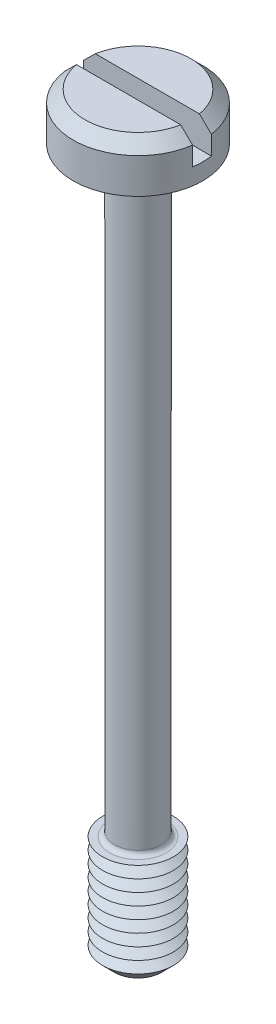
ISO-10303-21;
HEADER;
FILE_DESCRIPTION(('STEP AP214'),'2;1');
FILE_NAME('part.step','',(''),(''),'','','');
FILE_SCHEMA(('AUTOMOTIVE_DESIGN { 1 0 10303 214 1 1 1 1 }'));
ENDSEC;
DATA;
#1=APPLICATION_CONTEXT('core data for automotive mechanical design processes');
#2=APPLICATION_PROTOCOL_DEFINITION('international standard','automotive_design',2000,#1);
#3=PRODUCT_CONTEXT('',#1,'mechanical');
#4=PRODUCT('Part','Part','',(#3));
#5=PRODUCT_RELATED_PRODUCT_CATEGORY('part','',(#4));
#6=PRODUCT_DEFINITION_FORMATION('','',#4);
#7=PRODUCT_DEFINITION_CONTEXT('part definition',#1,'design');
#8=PRODUCT_DEFINITION('design','',#6,#7);
#9=PRODUCT_DEFINITION_SHAPE('','',#8);
#10=(LENGTH_UNIT() NAMED_UNIT(*) SI_UNIT(.MILLI.,.METRE.));
#11=(NAMED_UNIT(*) PLANE_ANGLE_UNIT() SI_UNIT($,.RADIAN.));
#12=(NAMED_UNIT(*) SI_UNIT($,.STERADIAN.) SOLID_ANGLE_UNIT());
#13=UNCERTAINTY_MEASURE_WITH_UNIT(LENGTH_MEASURE(1.E-05),#10,'distance_accuracy_value','');
#14=(GEOMETRIC_REPRESENTATION_CONTEXT(3) GLOBAL_UNCERTAINTY_ASSIGNED_CONTEXT((#13)) GLOBAL_UNIT_ASSIGNED_CONTEXT((#10,
#11,#12)) REPRESENTATION_CONTEXT('',''));
#15=CARTESIAN_POINT('',(0.,0.,0.));
#16=DIRECTION('',(0.,0.,1.));
#17=DIRECTION('',(1.,0.,0.));
#18=AXIS2_PLACEMENT_3D('',#15,#16,#17);
#19=CARTESIAN_POINT('',(0.,2.,0.));
#20=DIRECTION('',(0.,1.,0.));
#21=DIRECTION('',(0.,0.,1.));
#22=AXIS2_PLACEMENT_3D('',#19,#20,#21);
#23=PLANE('',#22);
#24=DIRECTION('',(-1.,0.,0.));
#25=VECTOR('',#24,1.);
#26=CARTESIAN_POINT('',(2.75,2.,-0.4));
#27=LINE('',#26,#25);
#28=CARTESIAN_POINT('',(2.21415898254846,2.,-0.4));
#29=VERTEX_POINT('',#28);
#30=CARTESIAN_POINT('',(-2.21415898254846,2.,-0.4));
#31=VERTEX_POINT('',#30);
#32=EDGE_CURVE('E110',#29,#31,#27,.T.);
#33=ORIENTED_EDGE('',*,*,#32,.F.);
#34=CARTESIAN_POINT('',(0.,2.,0.));
#35=DIRECTION('',(0.,1.,0.));
#36=DIRECTION('',(0.,0.,1.));
#37=AXIS2_PLACEMENT_3D('',#34,#35,#36);
#38=CIRCLE('',#37,2.25000000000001);
#39=EDGE_CURVE('E113',#29,#31,#38,.T.);
#40=ORIENTED_EDGE('',*,*,#39,.T.);
#41=EDGE_LOOP('',(#33,#40));
#42=FACE_BOUND('',#41,.T.);
#43=ADVANCED_FACE('F39',(#42),#23,.T.);
#44=CARTESIAN_POINT('',(0.,2.,0.));
#45=DIRECTION('',(0.,-1.,0.));
#46=DIRECTION('',(0.,0.,-1.));
#47=AXIS2_PLACEMENT_3D('',#44,#45,#46);
#48=CONICAL_SURFACE('',#47,2.25000000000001,0.785398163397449);
#49=CARTESIAN_POINT('',(6.05060089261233,-1.81380830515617,-0.4));
#50=CARTESIAN_POINT('',(5.84217393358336,-1.60583904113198,-0.4));
#51=CARTESIAN_POINT('',(5.63372707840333,-1.39788969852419,-0.4));
#52=CARTESIAN_POINT('',(5.21676338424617,-0.982052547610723,-0.4));
#53=CARTESIAN_POINT('',(5.00824654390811,-0.774164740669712,-0.4));
#54=CARTESIAN_POINT('',(4.59102343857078,-0.358383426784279,-0.4));
#55=CARTESIAN_POINT('',(4.38231713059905,-0.150489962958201,-0.4));
#56=CARTESIAN_POINT('',(3.96477014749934,0.26515359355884,-0.4));
#57=CARTESIAN_POINT('',(3.75592947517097,0.472903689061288,-0.4));
#58=CARTESIAN_POINT('',(3.33589913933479,0.890287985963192,-0.4));
#59=CARTESIAN_POINT('',(3.12470717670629,1.09991987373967,-0.4));
#60=CARTESIAN_POINT('',(2.70191340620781,1.51879562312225,-0.4));
#61=CARTESIAN_POINT('',(2.49031157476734,1.72803946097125,-0.4));
#62=CARTESIAN_POINT('',(2.17231429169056,2.04123939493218,-0.4));
#63=CARTESIAN_POINT('',(2.06623184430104,2.14551302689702,-0.4));
#64=CARTESIAN_POINT('',(1.85373145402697,2.35372301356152,-0.4));
#65=CARTESIAN_POINT('',(1.74731350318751,2.45765936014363,-0.4));
#66=CARTESIAN_POINT('',(1.53394692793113,2.6649644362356,-0.4));
#67=CARTESIAN_POINT('',(1.42699836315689,2.76833322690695,-0.4));
#68=CARTESIAN_POINT('',(1.26580938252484,2.92258234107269,-0.4));
#69=CARTESIAN_POINT('',(1.21195308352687,2.97386371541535,-0.4));
#70=CARTESIAN_POINT('',(1.10386632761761,3.07603025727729,-0.4));
#71=CARTESIAN_POINT('',(1.0496358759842,3.126915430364,-0.4));
#72=CARTESIAN_POINT('',(0.965529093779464,3.20495157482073,-0.4));
#73=CARTESIAN_POINT('',(0.935852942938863,3.23231811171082,-0.4));
#74=CARTESIAN_POINT('',(0.87628274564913,3.28681446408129,-0.4));
#75=CARTESIAN_POINT('',(0.846388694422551,3.31394427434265,-0.4));
#76=CARTESIAN_POINT('',(0.786319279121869,3.36788760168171,-0.4));
#77=CARTESIAN_POINT('',(0.756143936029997,3.39470114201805,-0.4));
#78=CARTESIAN_POINT('',(0.695411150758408,3.44788757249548,-0.4));
#79=CARTESIAN_POINT('',(0.664853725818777,3.4742604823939,-0.4));
#80=CARTESIAN_POINT('',(0.587773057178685,3.53947080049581,-0.4));
#81=CARTESIAN_POINT('',(0.540923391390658,3.57793090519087,-0.4));
#82=CARTESIAN_POINT('',(0.469108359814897,3.63368803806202,-0.4));
#83=CARTESIAN_POINT('',(0.444902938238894,3.65195872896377,-0.4));
#84=CARTESIAN_POINT('',(0.395796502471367,3.68753467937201,-0.4));
#85=CARTESIAN_POINT('',(0.370895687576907,3.70484021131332,-0.4));
#86=CARTESIAN_POINT('',(0.315135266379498,3.74129905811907,-0.4));
#87=CARTESIAN_POINT('',(0.284069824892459,3.76014262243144,-0.4));
#88=CARTESIAN_POINT('',(0.220007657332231,3.79429188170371,-0.4));
#89=CARTESIAN_POINT('',(0.187014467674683,3.80960381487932,-0.4));
#90=CARTESIAN_POINT('',(0.129469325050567,3.83013103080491,-0.4));
#91=CARTESIAN_POINT('',(0.105533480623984,3.83700748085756,-0.4));
#92=CARTESIAN_POINT('',(0.0568861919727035,3.8466714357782,-0.4));
#93=CARTESIAN_POINT('',(0.0321777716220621,3.84947323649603,-0.4));
#94=CARTESIAN_POINT('',(-0.0174556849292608,3.8503913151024,-0.4));
#95=CARTESIAN_POINT('',(-0.0423811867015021,3.84848412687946,-0.4));
#96=CARTESIAN_POINT('',(-0.0915464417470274,3.84038297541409,-0.4));
#97=CARTESIAN_POINT('',(-0.115784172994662,3.83417751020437,-0.4));
#98=CARTESIAN_POINT('',(-0.164015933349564,3.81830420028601,-0.4));
#99=CARTESIAN_POINT('',(-0.187969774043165,3.80851974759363,-0.4));
#100=CARTESIAN_POINT('',(-0.234812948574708,3.78663483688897,-0.4));
#101=CARTESIAN_POINT('',(-0.257700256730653,3.77453017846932,-0.4));
#102=CARTESIAN_POINT('',(-0.302761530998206,3.74868049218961,-0.4));
#103=CARTESIAN_POINT('',(-0.324928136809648,3.73492286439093,-0.4));
#104=CARTESIAN_POINT('',(-0.368536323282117,3.70635481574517,-0.4));
#105=CARTESIAN_POINT('',(-0.389978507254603,3.69154530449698,-0.4));
#106=CARTESIAN_POINT('',(-0.457169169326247,3.64340388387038,-0.4));
#107=CARTESIAN_POINT('',(-0.501937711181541,3.60871473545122,-0.4));
#108=CARTESIAN_POINT('',(-0.5900742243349,3.53759028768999,-0.4));
#109=CARTESIAN_POINT('',(-0.63344125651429,3.50115385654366,-0.4));
#110=CARTESIAN_POINT('',(-0.719371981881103,3.42718980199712,-0.4));
#111=CARTESIAN_POINT('',(-0.761934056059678,3.38966030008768,-0.4));
#112=CARTESIAN_POINT('',(-0.846465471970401,3.3139686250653,-0.4));
#113=CARTESIAN_POINT('',(-0.888434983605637,3.27580664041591,-0.4));
#114=CARTESIAN_POINT('',(-1.01351008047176,3.16091722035,-0.4));
#115=CARTESIAN_POINT('',(-1.0960373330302,3.08356131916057,-0.4));
#116=CARTESIAN_POINT('',(-1.26020205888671,2.9280930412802,-0.4));
#117=CARTESIAN_POINT('',(-1.34184039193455,2.84998156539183,-0.4));
#118=CARTESIAN_POINT('',(-1.50425180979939,2.69362860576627,-0.4));
#119=CARTESIAN_POINT('',(-1.58502715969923,2.61538947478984,-0.4));
#120=CARTESIAN_POINT('',(-1.74627332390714,2.45859784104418,-0.4));
#121=CARTESIAN_POINT('',(-1.82674413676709,2.38004533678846,-0.4));
#122=CARTESIAN_POINT('',(-2.06785619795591,2.14407469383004,-0.4));
#123=CARTESIAN_POINT('',(-2.22819388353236,1.98634651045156,-0.4));
#124=CARTESIAN_POINT('',(-2.54852691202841,1.670404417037,-0.4));
#125=CARTESIAN_POINT('',(-2.70852207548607,1.51219032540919,-0.4));
#126=CARTESIAN_POINT('',(-3.02826273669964,1.19551306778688,-0.4));
#127=CARTESIAN_POINT('',(-3.18800823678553,1.03704990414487,-0.4));
#128=CARTESIAN_POINT('',(-3.66699080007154,0.561455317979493,-0.4));
#129=CARTESIAN_POINT('',(-3.98599924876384,0.244093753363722,-0.4));
#130=CARTESIAN_POINT('',(-4.62369880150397,-0.390879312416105,-0.4));
#131=CARTESIAN_POINT('',(-4.9423899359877,-0.708490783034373,-0.4));
#132=CARTESIAN_POINT('',(-5.39262624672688,-1.15743192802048,-0.4));
#133=CARTESIAN_POINT('',(-5.52423897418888,-1.2886938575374,-0.4));
#134=CARTESIAN_POINT('',(-5.78743776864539,-1.55123695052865,-0.4));
#135=CARTESIAN_POINT('',(-5.91902383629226,-1.68251811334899,-0.4));
#136=CARTESIAN_POINT('',(-6.05060089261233,-1.81380830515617,-0.4));
#137=B_SPLINE_CURVE_WITH_KNOTS('',3,(#49,#50,#51,#52,#53,#54,#55,#56,#57,#58,#59,#60,#61,#62,
#63,#64,#65,#66,#67,#68,#69,#70,#71,#72,#73,#74,#75,#76,#77,#78,#79,#80,#81,#82,#83,#84,#85,#86,
#87,#88,#89,#90,#91,#92,#93,#94,#95,#96,#97,#98,#99,#100,#101,#102,#103,#104,#105,#106,#107,
#108,#109,#110,#111,#112,#113,#114,#115,#116,#117,#118,#119,#120,#121,#122,#123,#124,#125,#126,
#127,#128,#129,#130,#131,#132,#133,#134,#135,#136),.UNSPECIFIED.,.F.,.F.,(4,2,2,2,2,2,2,2,2,2,2,
2,2,2,2,2,2,2,2,2,2,2,2,2,2,2,2,2,2,2,2,2,2,2,2,2,2,2,2,2,2,2,2,4),(0.,0.883310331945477,
1.76663897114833,2.65038219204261,3.53410755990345,4.42681573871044,5.31957687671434,
5.76582544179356,6.21208466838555,6.65829482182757,6.88139126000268,7.10448455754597,
7.22558850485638,7.34669511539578,7.46779276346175,7.58888496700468,7.77066509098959,
7.86163037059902,7.95256984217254,8.06146372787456,8.17016376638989,8.24461141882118,
8.3187972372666,8.39335348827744,8.46811002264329,8.54555790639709,8.62314734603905,
8.70137101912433,8.77952785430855,8.949327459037,9.11923857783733,9.28946128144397,
9.45963414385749,9.79895964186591,10.1379210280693,10.475282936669,10.8126464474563,
11.4873867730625,12.1624208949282,12.8374486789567,14.1873973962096,15.5372009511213,
16.0948428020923,16.6524687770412),.UNSPECIFIED.);
#138=CARTESIAN_POINT('',(2.72075357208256,1.50000000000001,-0.4));
#139=VERTEX_POINT('',#138);
#140=EDGE_CURVE('E259',#139,#29,#137,.T.);
#141=ORIENTED_EDGE('',*,*,#140,.F.);
#142=CARTESIAN_POINT('',(0.,1.50000000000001,0.));
#143=DIRECTION('',(0.,1.,0.));
#144=DIRECTION('',(0.,0.,1.));
#145=AXIS2_PLACEMENT_3D('',#142,#143,#144);
#146=CIRCLE('',#145,2.75);
#147=CARTESIAN_POINT('',(-2.72075357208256,1.50000000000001,-0.4));
#148=VERTEX_POINT('',#147);
#149=EDGE_CURVE('E127',#148,#139,#146,.F.);
#150=ORIENTED_EDGE('',*,*,#149,.F.);
#151=EDGE_CURVE('E102',#31,#148,#137,.T.);
#152=ORIENTED_EDGE('',*,*,#151,.F.);
#153=ORIENTED_EDGE('',*,*,#39,.F.);
#154=EDGE_LOOP('',(#141,#150,#152,#153));
#155=FACE_BOUND('',#154,.T.);
#156=ADVANCED_FACE('F221',(#155),#48,.T.);
#157=CARTESIAN_POINT('',(0.,-30.,0.));
#158=DIRECTION('',(0.,1.,0.));
#159=DIRECTION('',(0.,0.,1.));
#160=AXIS2_PLACEMENT_3D('',#157,#158,#159);
#161=CYLINDRICAL_SURFACE('',#160,1.);
#162=CARTESIAN_POINT('',(0.,-25.3,0.));
#163=DIRECTION('',(0.,-1.,0.));
#164=DIRECTION('',(0.,0.,-1.));
#165=AXIS2_PLACEMENT_3D('',#162,#163,#164);
#166=CIRCLE('',#165,1.);
#167=CARTESIAN_POINT('',(0.,-25.3,-1.));
#168=VERTEX_POINT('',#167);
#169=EDGE_CURVE('E122',#168,#168,#166,.F.);
#170=ORIENTED_EDGE('',*,*,#169,.T.);
#171=EDGE_LOOP('',(#170));
#172=FACE_BOUND('',#171,.T.);
#173=CARTESIAN_POINT('',(0.,-0.199999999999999,0.));
#174=DIRECTION('',(0.,1.,0.));
#175=DIRECTION('',(0.,0.,1.));
#176=AXIS2_PLACEMENT_3D('',#173,#174,#175);
#177=CIRCLE('',#176,1.);
#178=CARTESIAN_POINT('',(0.,-0.199999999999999,1.));
#179=VERTEX_POINT('',#178);
#180=EDGE_CURVE('E365',#179,#179,#177,.F.);
#181=ORIENTED_EDGE('',*,*,#180,.T.);
#182=EDGE_LOOP('',(#181));
#183=FACE_BOUND('',#182,.T.);
#184=ADVANCED_FACE('F217',(#172,#183),#161,.T.);
#185=CARTESIAN_POINT('',(0.,2.,0.));
#186=DIRECTION('',(0.,-1.,0.));
#187=DIRECTION('',(0.,0.,-1.));
#188=AXIS2_PLACEMENT_3D('',#185,#186,#187);
#189=CYLINDRICAL_SURFACE('',#188,2.75);
#190=ORIENTED_EDGE('',*,*,#149,.T.);
#191=DIRECTION('',(0.,-1.,0.));
#192=VECTOR('',#191,1.);
#193=CARTESIAN_POINT('',(2.72075357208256,2.,-0.4));
#194=LINE('',#193,#192);
#195=CARTESIAN_POINT('',(2.72075357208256,0.7,-0.4));
#196=VERTEX_POINT('',#195);
#197=EDGE_CURVE('E64',#139,#196,#194,.T.);
#198=ORIENTED_EDGE('',*,*,#197,.T.);
#199=CARTESIAN_POINT('',(0.,0.7,0.));
#200=DIRECTION('',(0.,1.,0.));
#201=DIRECTION('',(0.,0.,1.));
#202=AXIS2_PLACEMENT_3D('',#199,#200,#201);
#203=CIRCLE('',#202,2.75);
#204=CARTESIAN_POINT('',(2.72075357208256,0.7,0.4));
#205=VERTEX_POINT('',#204);
#206=EDGE_CURVE('E11',#205,#196,#203,.T.);
#207=ORIENTED_EDGE('',*,*,#206,.F.);
#208=DIRECTION('',(0.,-1.,0.));
#209=VECTOR('',#208,1.);
#210=CARTESIAN_POINT('',(2.72075357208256,2.,0.4));
#211=LINE('',#210,#209);
#212=CARTESIAN_POINT('',(2.72075357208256,1.50000000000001,0.4));
#213=VERTEX_POINT('',#212);
#214=EDGE_CURVE('E276',#205,#213,#211,.F.);
#215=ORIENTED_EDGE('',*,*,#214,.T.);
#216=CARTESIAN_POINT('',(-2.72075357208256,1.50000000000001,0.4));
#217=VERTEX_POINT('',#216);
#218=EDGE_CURVE('E119',#213,#217,#146,.F.);
#219=ORIENTED_EDGE('',*,*,#218,.T.);
#220=DIRECTION('',(0.,-1.,0.));
#221=VECTOR('',#220,1.);
#222=CARTESIAN_POINT('',(-2.72075357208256,2.,0.4));
#223=LINE('',#222,#221);
#224=CARTESIAN_POINT('',(-2.72075357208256,0.7,0.4));
#225=VERTEX_POINT('',#224);
#226=EDGE_CURVE('E96',#217,#225,#223,.T.);
#227=ORIENTED_EDGE('',*,*,#226,.T.);
#228=CARTESIAN_POINT('',(-2.72075357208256,0.7,-0.4));
#229=VERTEX_POINT('',#228);
#230=EDGE_CURVE('E44',#229,#225,#203,.T.);
#231=ORIENTED_EDGE('',*,*,#230,.F.);
#232=DIRECTION('',(0.,-1.,0.));
#233=VECTOR('',#232,1.);
#234=CARTESIAN_POINT('',(-2.72075357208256,2.,-0.4));
#235=LINE('',#234,#233);
#236=EDGE_CURVE('E281',#229,#148,#235,.F.);
#237=ORIENTED_EDGE('',*,*,#236,.T.);
#238=EDGE_LOOP('',(#190,#198,#207,#215,#219,#227,#231,#237));
#239=FACE_BOUND('',#238,.T.);
#240=CARTESIAN_POINT('',(0.,0.,0.));
#241=DIRECTION('',(0.,1.,0.));
#242=DIRECTION('',(0.,0.,1.));
#243=AXIS2_PLACEMENT_3D('',#240,#241,#242);
#244=CIRCLE('',#243,2.75);
#245=CARTESIAN_POINT('',(0.,0.,2.75));
#246=VERTEX_POINT('',#245);
#247=EDGE_CURVE('E354',#246,#246,#244,.T.);
#248=ORIENTED_EDGE('',*,*,#247,.T.);
#249=EDGE_LOOP('',(#248));
#250=FACE_BOUND('',#249,.T.);
#251=ADVANCED_FACE('F220',(#239,#250),#189,.T.);
#252=DIRECTION('',(1.,0.,0.));
#253=VECTOR('',#252,1.);
#254=CARTESIAN_POINT('',(2.75,2.,0.4));
#255=LINE('',#254,#253);
#256=CARTESIAN_POINT('',(-2.21415898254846,2.,0.4));
#257=VERTEX_POINT('',#256);
#258=CARTESIAN_POINT('',(2.21415898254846,2.,0.4));
#259=VERTEX_POINT('',#258);
#260=EDGE_CURVE('E56',#257,#259,#255,.T.);
#261=ORIENTED_EDGE('',*,*,#260,.F.);
#262=EDGE_CURVE('E108',#257,#259,#38,.T.);
#263=ORIENTED_EDGE('',*,*,#262,.T.);
#264=EDGE_LOOP('',(#261,#263));
#265=FACE_BOUND('',#264,.T.);
#266=ADVANCED_FACE('F107',(#265),#23,.T.);
#267=CARTESIAN_POINT('',(0.,0.,0.));
#268=DIRECTION('',(0.,1.,0.));
#269=DIRECTION('',(0.,0.,1.));
#270=AXIS2_PLACEMENT_3D('',#267,#268,#269);
#271=PLANE('',#270);
#272=CARTESIAN_POINT('',(0.,0.,0.));
#273=DIRECTION('',(0.,1.,0.));
#274=DIRECTION('',(0.,0.,1.));
#275=AXIS2_PLACEMENT_3D('',#272,#273,#274);
#276=CIRCLE('',#275,1.2);
#277=CARTESIAN_POINT('',(0.,0.,1.2));
#278=VERTEX_POINT('',#277);
#279=EDGE_CURVE('E114',#278,#278,#276,.T.);
#280=ORIENTED_EDGE('',*,*,#279,.T.);
#281=EDGE_LOOP('',(#280));
#282=FACE_BOUND('',#281,.T.);
#283=ORIENTED_EDGE('',*,*,#247,.F.);
#284=EDGE_LOOP('',(#283));
#285=FACE_BOUND('',#284,.T.);
#286=ADVANCED_FACE('F211',(#282,#285),#271,.F.);
#287=CARTESIAN_POINT('',(0.,-25.5,0.));
#288=DIRECTION('',(0.,-1.,0.));
#289=DIRECTION('',(0.,0.,-1.));
#290=AXIS2_PLACEMENT_3D('',#287,#288,#289);
#291=PLANE('',#290);
#292=CARTESIAN_POINT('',(0.,-25.5,0.));
#293=DIRECTION('',(0.,-1.,0.));
#294=DIRECTION('',(0.,0.,-1.));
#295=AXIS2_PLACEMENT_3D('',#292,#293,#294);
#296=CIRCLE('',#295,1.2);
#297=CARTESIAN_POINT('',(0.,-25.5,-1.2));
#298=VERTEX_POINT('',#297);
#299=EDGE_CURVE('E362',#298,#298,#296,.T.);
#300=ORIENTED_EDGE('',*,*,#299,.T.);
#301=EDGE_LOOP('',(#300));
#302=FACE_BOUND('',#301,.T.);
#303=CARTESIAN_POINT('',(0.,-25.5,0.));
#304=DIRECTION('',(0.,1.,0.));
#305=DIRECTION('',(0.,0.,1.));
#306=AXIS2_PLACEMENT_3D('',#303,#304,#305);
#307=CIRCLE('',#306,1.5);
#308=CARTESIAN_POINT('',(0.,-25.5,1.5));
#309=VERTEX_POINT('',#308);
#310=EDGE_CURVE('E350',#309,#309,#307,.T.);
#311=ORIENTED_EDGE('',*,*,#310,.T.);
#312=EDGE_LOOP('',(#311));
#313=FACE_BOUND('',#312,.T.);
#314=ADVANCED_FACE('F207',(#302,#313),#291,.F.);
#315=CARTESIAN_POINT('',(0.,-25.75,0.));
#316=DIRECTION('',(0.,1.,0.));
#317=DIRECTION('',(0.,0.,1.));
#318=AXIS2_PLACEMENT_3D('',#315,#316,#317);
#319=CONICAL_SURFACE('',#318,1.06698729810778,1.0471975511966);
#320=ORIENTED_EDGE('',*,*,#310,.F.);
#321=EDGE_LOOP('',(#320));
#322=FACE_BOUND('',#321,.T.);
#323=CARTESIAN_POINT('',(0.,-25.75,0.));
#324=DIRECTION('',(0.,1.,0.));
#325=DIRECTION('',(0.,0.,1.));
#326=AXIS2_PLACEMENT_3D('',#323,#324,#325);
#327=CIRCLE('',#326,1.06698729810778);
#328=CARTESIAN_POINT('',(0.,-25.75,1.06698729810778));
#329=VERTEX_POINT('',#328);
#330=EDGE_CURVE('E346',#329,#329,#327,.T.);
#331=ORIENTED_EDGE('',*,*,#330,.T.);
#332=EDGE_LOOP('',(#331));
#333=FACE_BOUND('',#332,.T.);
#334=ADVANCED_FACE('F203',(#322,#333),#319,.T.);
#335=CARTESIAN_POINT('',(0.,-26.,0.));
#336=DIRECTION('',(0.,-1.,0.));
#337=DIRECTION('',(0.,0.,-1.));
#338=AXIS2_PLACEMENT_3D('',#335,#336,#337);
#339=CONICAL_SURFACE('',#338,1.5,1.0471975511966);
#340=ORIENTED_EDGE('',*,*,#330,.F.);
#341=EDGE_LOOP('',(#340));
#342=FACE_BOUND('',#341,.T.);
#343=CARTESIAN_POINT('',(0.,-26.,0.));
#344=DIRECTION('',(0.,1.,0.));
#345=DIRECTION('',(0.,0.,1.));
#346=AXIS2_PLACEMENT_3D('',#343,#344,#345);
#347=CIRCLE('',#346,1.5);
#348=CARTESIAN_POINT('',(0.,-26.,1.5));
#349=VERTEX_POINT('',#348);
#350=EDGE_CURVE('E342',#349,#349,#347,.T.);
#351=ORIENTED_EDGE('',*,*,#350,.T.);
#352=EDGE_LOOP('',(#351));
#353=FACE_BOUND('',#352,.T.);
#354=ADVANCED_FACE('F199',(#342,#353),#339,.T.);
#355=CARTESIAN_POINT('',(0.,-26.25,0.));
#356=DIRECTION('',(0.,1.,0.));
#357=DIRECTION('',(0.,0.,1.));
#358=AXIS2_PLACEMENT_3D('',#355,#356,#357);
#359=CONICAL_SURFACE('',#358,1.06698729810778,1.0471975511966);
#360=ORIENTED_EDGE('',*,*,#350,.F.);
#361=EDGE_LOOP('',(#360));
#362=FACE_BOUND('',#361,.T.);
#363=CARTESIAN_POINT('',(0.,-26.25,0.));
#364=DIRECTION('',(0.,1.,0.));
#365=DIRECTION('',(0.,0.,1.));
#366=AXIS2_PLACEMENT_3D('',#363,#364,#365);
#367=CIRCLE('',#366,1.06698729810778);
#368=CARTESIAN_POINT('',(0.,-26.25,1.06698729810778));
#369=VERTEX_POINT('',#368);
#370=EDGE_CURVE('E338',#369,#369,#367,.T.);
#371=ORIENTED_EDGE('',*,*,#370,.T.);
#372=EDGE_LOOP('',(#371));
#373=FACE_BOUND('',#372,.T.);
#374=ADVANCED_FACE('F195',(#362,#373),#359,.T.);
#375=CARTESIAN_POINT('',(0.,-26.5,0.));
#376=DIRECTION('',(0.,-1.,0.));
#377=DIRECTION('',(0.,0.,-1.));
#378=AXIS2_PLACEMENT_3D('',#375,#376,#377);
#379=CONICAL_SURFACE('',#378,1.5,1.0471975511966);
#380=ORIENTED_EDGE('',*,*,#370,.F.);
#381=EDGE_LOOP('',(#380));
#382=FACE_BOUND('',#381,.T.);
#383=CARTESIAN_POINT('',(0.,-26.5,0.));
#384=DIRECTION('',(0.,1.,0.));
#385=DIRECTION('',(0.,0.,1.));
#386=AXIS2_PLACEMENT_3D('',#383,#384,#385);
#387=CIRCLE('',#386,1.5);
#388=CARTESIAN_POINT('',(0.,-26.5,1.5));
#389=VERTEX_POINT('',#388);
#390=EDGE_CURVE('E335',#389,#389,#387,.T.);
#391=ORIENTED_EDGE('',*,*,#390,.T.);
#392=EDGE_LOOP('',(#391));
#393=FACE_BOUND('',#392,.T.);
#394=ADVANCED_FACE('F191',(#382,#393),#379,.T.);
#395=CARTESIAN_POINT('',(0.,-26.75,0.));
#396=DIRECTION('',(0.,1.,0.));
#397=DIRECTION('',(0.,0.,1.));
#398=AXIS2_PLACEMENT_3D('',#395,#396,#397);
#399=CONICAL_SURFACE('',#398,1.06698729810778,1.0471975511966);
#400=ORIENTED_EDGE('',*,*,#390,.F.);
#401=EDGE_LOOP('',(#400));
#402=FACE_BOUND('',#401,.T.);
#403=CARTESIAN_POINT('',(0.,-26.75,0.));
#404=DIRECTION('',(0.,1.,0.));
#405=DIRECTION('',(0.,0.,1.));
#406=AXIS2_PLACEMENT_3D('',#403,#404,#405);
#407=CIRCLE('',#406,1.06698729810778);
#408=CARTESIAN_POINT('',(0.,-26.75,1.06698729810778));
#409=VERTEX_POINT('',#408);
#410=EDGE_CURVE('E332',#409,#409,#407,.T.);
#411=ORIENTED_EDGE('',*,*,#410,.T.);
#412=EDGE_LOOP('',(#411));
#413=FACE_BOUND('',#412,.T.);
#414=ADVANCED_FACE('F187',(#402,#413),#399,.T.);
#415=CARTESIAN_POINT('',(0.,-27.,0.));
#416=DIRECTION('',(0.,-1.,0.));
#417=DIRECTION('',(0.,0.,-1.));
#418=AXIS2_PLACEMENT_3D('',#415,#416,#417);
#419=CONICAL_SURFACE('',#418,1.5,1.0471975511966);
#420=ORIENTED_EDGE('',*,*,#410,.F.);
#421=EDGE_LOOP('',(#420));
#422=FACE_BOUND('',#421,.T.);
#423=CARTESIAN_POINT('',(0.,-27.,0.));
#424=DIRECTION('',(0.,1.,0.));
#425=DIRECTION('',(0.,0.,1.));
#426=AXIS2_PLACEMENT_3D('',#423,#424,#425);
#427=CIRCLE('',#426,1.5);
#428=CARTESIAN_POINT('',(0.,-27.,1.5));
#429=VERTEX_POINT('',#428);
#430=EDGE_CURVE('E328',#429,#429,#427,.T.);
#431=ORIENTED_EDGE('',*,*,#430,.T.);
#432=EDGE_LOOP('',(#431));
#433=FACE_BOUND('',#432,.T.);
#434=ADVANCED_FACE('F183',(#422,#433),#419,.T.);
#435=CARTESIAN_POINT('',(0.,-27.25,0.));
#436=DIRECTION('',(0.,1.,0.));
#437=DIRECTION('',(0.,0.,1.));
#438=AXIS2_PLACEMENT_3D('',#435,#436,#437);
#439=CONICAL_SURFACE('',#438,1.06698729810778,1.0471975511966);
#440=ORIENTED_EDGE('',*,*,#430,.F.);
#441=EDGE_LOOP('',(#440));
#442=FACE_BOUND('',#441,.T.);
#443=CARTESIAN_POINT('',(0.,-27.25,0.));
#444=DIRECTION('',(0.,1.,0.));
#445=DIRECTION('',(0.,0.,1.));
#446=AXIS2_PLACEMENT_3D('',#443,#444,#445);
#447=CIRCLE('',#446,1.06698729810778);
#448=CARTESIAN_POINT('',(0.,-27.25,1.06698729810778));
#449=VERTEX_POINT('',#448);
#450=EDGE_CURVE('E324',#449,#449,#447,.T.);
#451=ORIENTED_EDGE('',*,*,#450,.T.);
#452=EDGE_LOOP('',(#451));
#453=FACE_BOUND('',#452,.T.);
#454=ADVANCED_FACE('F179',(#442,#453),#439,.T.);
#455=CARTESIAN_POINT('',(0.,-27.5,0.));
#456=DIRECTION('',(0.,-1.,0.));
#457=DIRECTION('',(0.,0.,-1.));
#458=AXIS2_PLACEMENT_3D('',#455,#456,#457);
#459=CONICAL_SURFACE('',#458,1.5,1.0471975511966);
#460=ORIENTED_EDGE('',*,*,#450,.F.);
#461=EDGE_LOOP('',(#460));
#462=FACE_BOUND('',#461,.T.);
#463=CARTESIAN_POINT('',(0.,-27.5,0.));
#464=DIRECTION('',(0.,1.,0.));
#465=DIRECTION('',(0.,0.,1.));
#466=AXIS2_PLACEMENT_3D('',#463,#464,#465);
#467=CIRCLE('',#466,1.5);
#468=CARTESIAN_POINT('',(0.,-27.5,1.5));
#469=VERTEX_POINT('',#468);
#470=EDGE_CURVE('E320',#469,#469,#467,.T.);
#471=ORIENTED_EDGE('',*,*,#470,.T.);
#472=EDGE_LOOP('',(#471));
#473=FACE_BOUND('',#472,.T.);
#474=ADVANCED_FACE('F175',(#462,#473),#459,.T.);
#475=CARTESIAN_POINT('',(0.,-27.75,0.));
#476=DIRECTION('',(0.,1.,0.));
#477=DIRECTION('',(0.,0.,1.));
#478=AXIS2_PLACEMENT_3D('',#475,#476,#477);
#479=CONICAL_SURFACE('',#478,1.06698729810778,1.0471975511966);
#480=ORIENTED_EDGE('',*,*,#470,.F.);
#481=EDGE_LOOP('',(#480));
#482=FACE_BOUND('',#481,.T.);
#483=CARTESIAN_POINT('',(0.,-27.75,0.));
#484=DIRECTION('',(0.,1.,0.));
#485=DIRECTION('',(0.,0.,1.));
#486=AXIS2_PLACEMENT_3D('',#483,#484,#485);
#487=CIRCLE('',#486,1.06698729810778);
#488=CARTESIAN_POINT('',(0.,-27.75,1.06698729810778));
#489=VERTEX_POINT('',#488);
#490=EDGE_CURVE('E317',#489,#489,#487,.T.);
#491=ORIENTED_EDGE('',*,*,#490,.T.);
#492=EDGE_LOOP('',(#491));
#493=FACE_BOUND('',#492,.T.);
#494=ADVANCED_FACE('F171',(#482,#493),#479,.T.);
#495=CARTESIAN_POINT('',(0.,-28.,0.));
#496=DIRECTION('',(0.,-1.,0.));
#497=DIRECTION('',(0.,0.,-1.));
#498=AXIS2_PLACEMENT_3D('',#495,#496,#497);
#499=CONICAL_SURFACE('',#498,1.5,1.0471975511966);
#500=ORIENTED_EDGE('',*,*,#490,.F.);
#501=EDGE_LOOP('',(#500));
#502=FACE_BOUND('',#501,.T.);
#503=CARTESIAN_POINT('',(0.,-28.,0.));
#504=DIRECTION('',(0.,1.,0.));
#505=DIRECTION('',(0.,0.,1.));
#506=AXIS2_PLACEMENT_3D('',#503,#504,#505);
#507=CIRCLE('',#506,1.5);
#508=CARTESIAN_POINT('',(0.,-28.,1.5));
#509=VERTEX_POINT('',#508);
#510=EDGE_CURVE('E313',#509,#509,#507,.T.);
#511=ORIENTED_EDGE('',*,*,#510,.T.);
#512=EDGE_LOOP('',(#511));
#513=FACE_BOUND('',#512,.T.);
#514=ADVANCED_FACE('F167',(#502,#513),#499,.T.);
#515=CARTESIAN_POINT('',(0.,-28.25,0.));
#516=DIRECTION('',(0.,1.,0.));
#517=DIRECTION('',(0.,0.,1.));
#518=AXIS2_PLACEMENT_3D('',#515,#516,#517);
#519=CONICAL_SURFACE('',#518,1.06698729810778,1.0471975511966);
#520=ORIENTED_EDGE('',*,*,#510,.F.);
#521=EDGE_LOOP('',(#520));
#522=FACE_BOUND('',#521,.T.);
#523=CARTESIAN_POINT('',(0.,-28.25,0.));
#524=DIRECTION('',(0.,1.,0.));
#525=DIRECTION('',(0.,0.,1.));
#526=AXIS2_PLACEMENT_3D('',#523,#524,#525);
#527=CIRCLE('',#526,1.06698729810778);
#528=CARTESIAN_POINT('',(0.,-28.25,1.06698729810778));
#529=VERTEX_POINT('',#528);
#530=EDGE_CURVE('E310',#529,#529,#527,.T.);
#531=ORIENTED_EDGE('',*,*,#530,.T.);
#532=EDGE_LOOP('',(#531));
#533=FACE_BOUND('',#532,.T.);
#534=ADVANCED_FACE('F163',(#522,#533),#519,.T.);
#535=CARTESIAN_POINT('',(0.,-28.5,0.));
#536=DIRECTION('',(0.,-1.,0.));
#537=DIRECTION('',(0.,0.,-1.));
#538=AXIS2_PLACEMENT_3D('',#535,#536,#537);
#539=CONICAL_SURFACE('',#538,1.5,1.0471975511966);
#540=ORIENTED_EDGE('',*,*,#530,.F.);
#541=EDGE_LOOP('',(#540));
#542=FACE_BOUND('',#541,.T.);
#543=CARTESIAN_POINT('',(0.,-28.5,0.));
#544=DIRECTION('',(0.,1.,0.));
#545=DIRECTION('',(0.,0.,1.));
#546=AXIS2_PLACEMENT_3D('',#543,#544,#545);
#547=CIRCLE('',#546,1.5);
#548=CARTESIAN_POINT('',(0.,-28.5,1.5));
#549=VERTEX_POINT('',#548);
#550=EDGE_CURVE('E306',#549,#549,#547,.T.);
#551=ORIENTED_EDGE('',*,*,#550,.T.);
#552=EDGE_LOOP('',(#551));
#553=FACE_BOUND('',#552,.T.);
#554=ADVANCED_FACE('F159',(#542,#553),#539,.T.);
#555=CARTESIAN_POINT('',(0.,-28.75,0.));
#556=DIRECTION('',(0.,1.,0.));
#557=DIRECTION('',(0.,0.,1.));
#558=AXIS2_PLACEMENT_3D('',#555,#556,#557);
#559=CONICAL_SURFACE('',#558,1.06698729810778,1.0471975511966);
#560=ORIENTED_EDGE('',*,*,#550,.F.);
#561=EDGE_LOOP('',(#560));
#562=FACE_BOUND('',#561,.T.);
#563=CARTESIAN_POINT('',(0.,-28.75,0.));
#564=DIRECTION('',(0.,1.,0.));
#565=DIRECTION('',(0.,0.,1.));
#566=AXIS2_PLACEMENT_3D('',#563,#564,#565);
#567=CIRCLE('',#566,1.06698729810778);
#568=CARTESIAN_POINT('',(0.,-28.75,1.06698729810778));
#569=VERTEX_POINT('',#568);
#570=EDGE_CURVE('E302',#569,#569,#567,.T.);
#571=ORIENTED_EDGE('',*,*,#570,.T.);
#572=EDGE_LOOP('',(#571));
#573=FACE_BOUND('',#572,.T.);
#574=ADVANCED_FACE('F155',(#562,#573),#559,.T.);
#575=CARTESIAN_POINT('',(0.,-29.,0.));
#576=DIRECTION('',(0.,-1.,0.));
#577=DIRECTION('',(0.,0.,-1.));
#578=AXIS2_PLACEMENT_3D('',#575,#576,#577);
#579=CONICAL_SURFACE('',#578,1.5,1.0471975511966);
#580=ORIENTED_EDGE('',*,*,#570,.F.);
#581=EDGE_LOOP('',(#580));
#582=FACE_BOUND('',#581,.T.);
#583=CARTESIAN_POINT('',(0.,-29.,0.));
#584=DIRECTION('',(0.,1.,0.));
#585=DIRECTION('',(0.,0.,1.));
#586=AXIS2_PLACEMENT_3D('',#583,#584,#585);
#587=CIRCLE('',#586,1.5);
#588=CARTESIAN_POINT('',(0.,-29.,1.5));
#589=VERTEX_POINT('',#588);
#590=EDGE_CURVE('E298',#589,#589,#587,.T.);
#591=ORIENTED_EDGE('',*,*,#590,.T.);
#592=EDGE_LOOP('',(#591));
#593=FACE_BOUND('',#592,.T.);
#594=ADVANCED_FACE('F151',(#582,#593),#579,.T.);
#595=CARTESIAN_POINT('',(0.,-29.25,0.));
#596=DIRECTION('',(0.,1.,0.));
#597=DIRECTION('',(0.,0.,1.));
#598=AXIS2_PLACEMENT_3D('',#595,#596,#597);
#599=CONICAL_SURFACE('',#598,1.06698729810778,1.0471975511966);
#600=ORIENTED_EDGE('',*,*,#590,.F.);
#601=EDGE_LOOP('',(#600));
#602=FACE_BOUND('',#601,.T.);
#603=CARTESIAN_POINT('',(0.,-29.25,0.));
#604=DIRECTION('',(0.,1.,0.));
#605=DIRECTION('',(0.,0.,1.));
#606=AXIS2_PLACEMENT_3D('',#603,#604,#605);
#607=CIRCLE('',#606,1.06698729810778);
#608=CARTESIAN_POINT('',(0.,-29.25,1.06698729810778));
#609=VERTEX_POINT('',#608);
#610=EDGE_CURVE('E295',#609,#609,#607,.T.);
#611=ORIENTED_EDGE('',*,*,#610,.T.);
#612=EDGE_LOOP('',(#611));
#613=FACE_BOUND('',#612,.T.);
#614=ADVANCED_FACE('F147',(#602,#613),#599,.T.);
#615=CARTESIAN_POINT('',(0.,-29.5,0.));
#616=DIRECTION('',(0.,-1.,0.));
#617=DIRECTION('',(0.,0.,-1.));
#618=AXIS2_PLACEMENT_3D('',#615,#616,#617);
#619=CONICAL_SURFACE('',#618,1.5,1.0471975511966);
#620=ORIENTED_EDGE('',*,*,#610,.F.);
#621=EDGE_LOOP('',(#620));
#622=FACE_BOUND('',#621,.T.);
#623=CARTESIAN_POINT('',(0.,-29.5,0.));
#624=DIRECTION('',(0.,1.,0.));
#625=DIRECTION('',(0.,0.,1.));
#626=AXIS2_PLACEMENT_3D('',#623,#624,#625);
#627=CIRCLE('',#626,1.5);
#628=CARTESIAN_POINT('',(0.,-29.5,1.5));
#629=VERTEX_POINT('',#628);
#630=EDGE_CURVE('E291',#629,#629,#627,.T.);
#631=ORIENTED_EDGE('',*,*,#630,.T.);
#632=EDGE_LOOP('',(#631));
#633=FACE_BOUND('',#632,.T.);
#634=ADVANCED_FACE('F143',(#622,#633),#619,.T.);
#635=CARTESIAN_POINT('',(0.,-30.,0.));
#636=DIRECTION('',(0.,-1.,0.));
#637=DIRECTION('',(0.,0.,-1.));
#638=AXIS2_PLACEMENT_3D('',#635,#636,#637);
#639=PLANE('',#638);
#640=CARTESIAN_POINT('',(0.,-30.,0.));
#641=DIRECTION('',(0.,-1.,0.));
#642=DIRECTION('',(0.,0.,-1.));
#643=AXIS2_PLACEMENT_3D('',#640,#641,#642);
#644=CIRCLE('',#643,1.00000000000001);
#645=CARTESIAN_POINT('',(0.,-30.,-1.00000000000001));
#646=VERTEX_POINT('',#645);
#647=EDGE_CURVE('E358',#646,#646,#644,.T.);
#648=ORIENTED_EDGE('',*,*,#647,.T.);
#649=EDGE_LOOP('',(#648));
#650=FACE_BOUND('',#649,.T.);
#651=ADVANCED_FACE('F146',(#650),#639,.T.);
#652=CARTESIAN_POINT('',(0.,-30.,0.));
#653=DIRECTION('',(0.,1.,0.));
#654=DIRECTION('',(0.,0.,1.));
#655=AXIS2_PLACEMENT_3D('',#652,#653,#654);
#656=CONICAL_SURFACE('',#655,1.00000000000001,0.785398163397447);
#657=ORIENTED_EDGE('',*,*,#630,.F.);
#658=EDGE_LOOP('',(#657));
#659=FACE_BOUND('',#658,.T.);
#660=ORIENTED_EDGE('',*,*,#647,.F.);
#661=EDGE_LOOP('',(#660));
#662=FACE_BOUND('',#661,.T.);
#663=ADVANCED_FACE('F215',(#659,#662),#656,.T.);
#664=CARTESIAN_POINT('',(0.,-25.3,0.));
#665=DIRECTION('',(0.,-1.,0.));
#666=DIRECTION('',(0.,0.,-1.));
#667=AXIS2_PLACEMENT_3D('',#664,#665,#666);
#668=TOROIDAL_SURFACE('',#667,1.2,0.2);
#669=ORIENTED_EDGE('',*,*,#169,.F.);
#670=EDGE_LOOP('',(#669));
#671=FACE_BOUND('',#670,.T.);
#672=ORIENTED_EDGE('',*,*,#299,.F.);
#673=EDGE_LOOP('',(#672));
#674=FACE_BOUND('',#673,.T.);
#675=ADVANCED_FACE('F233',(#671,#674),#668,.F.);
#676=CARTESIAN_POINT('',(0.,-0.199999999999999,0.));
#677=DIRECTION('',(0.,1.,0.));
#678=DIRECTION('',(0.,0.,1.));
#679=AXIS2_PLACEMENT_3D('',#676,#677,#678);
#680=TOROIDAL_SURFACE('',#679,1.2,0.2);
#681=ORIENTED_EDGE('',*,*,#279,.F.);
#682=EDGE_LOOP('',(#681));
#683=FACE_BOUND('',#682,.T.);
#684=ORIENTED_EDGE('',*,*,#180,.F.);
#685=EDGE_LOOP('',(#684));
#686=FACE_BOUND('',#685,.T.);
#687=ADVANCED_FACE('F236',(#683,#686),#680,.F.);
#688=CARTESIAN_POINT('',(-6.05060089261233,-1.81380830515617,0.4));
#689=CARTESIAN_POINT('',(-5.84217393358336,-1.60583904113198,0.4));
#690=CARTESIAN_POINT('',(-5.63372707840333,-1.39788969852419,0.4));
#691=CARTESIAN_POINT('',(-5.21676338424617,-0.982052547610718,0.4));
#692=CARTESIAN_POINT('',(-5.0082465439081,-0.774164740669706,0.4));
#693=CARTESIAN_POINT('',(-4.59102343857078,-0.358383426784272,0.4));
#694=CARTESIAN_POINT('',(-4.38231713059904,-0.150489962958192,0.4));
#695=CARTESIAN_POINT('',(-3.96477014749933,0.265153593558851,0.4));
#696=CARTESIAN_POINT('',(-3.75592947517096,0.4729036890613,0.4));
#697=CARTESIAN_POINT('',(-3.33589913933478,0.890287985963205,0.4));
#698=CARTESIAN_POINT('',(-3.12470717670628,1.09991987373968,0.4));
#699=CARTESIAN_POINT('',(-2.7019134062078,1.51879562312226,0.4));
#700=CARTESIAN_POINT('',(-2.49031157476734,1.72803946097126,0.4));
#701=CARTESIAN_POINT('',(-2.17231429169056,2.04123939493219,0.4));
#702=CARTESIAN_POINT('',(-2.06623184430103,2.14551302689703,0.4));
#703=CARTESIAN_POINT('',(-1.85373145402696,2.35372301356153,0.4));
#704=CARTESIAN_POINT('',(-1.7473135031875,2.45765936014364,0.4));
#705=CARTESIAN_POINT('',(-1.53394692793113,2.6649644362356,0.4));
#706=CARTESIAN_POINT('',(-1.42699836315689,2.76833322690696,0.4));
#707=CARTESIAN_POINT('',(-1.26580938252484,2.92258234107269,0.4));
#708=CARTESIAN_POINT('',(-1.21195308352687,2.97386371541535,0.4));
#709=CARTESIAN_POINT('',(-1.10386632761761,3.07603025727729,0.4));
#710=CARTESIAN_POINT('',(-1.0496358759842,3.126915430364,0.4));
#711=CARTESIAN_POINT('',(-0.965529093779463,3.20495157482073,0.4));
#712=CARTESIAN_POINT('',(-0.935852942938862,3.23231811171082,0.4));
#713=CARTESIAN_POINT('',(-0.87628274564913,3.28681446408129,0.4));
#714=CARTESIAN_POINT('',(-0.84638869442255,3.31394427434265,0.4));
#715=CARTESIAN_POINT('',(-0.786319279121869,3.36788760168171,0.4));
#716=CARTESIAN_POINT('',(-0.756143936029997,3.39470114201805,0.4));
#717=CARTESIAN_POINT('',(-0.695411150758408,3.44788757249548,0.4));
#718=CARTESIAN_POINT('',(-0.664853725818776,3.4742604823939,0.4));
#719=CARTESIAN_POINT('',(-0.587773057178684,3.53947080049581,0.4));
#720=CARTESIAN_POINT('',(-0.540923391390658,3.57793090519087,0.4));
#721=CARTESIAN_POINT('',(-0.469108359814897,3.63368803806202,0.4));
#722=CARTESIAN_POINT('',(-0.444902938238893,3.65195872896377,0.4));
#723=CARTESIAN_POINT('',(-0.395796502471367,3.68753467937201,0.4));
#724=CARTESIAN_POINT('',(-0.370895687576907,3.70484021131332,0.4));
#725=CARTESIAN_POINT('',(-0.315135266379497,3.74129905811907,0.4));
#726=CARTESIAN_POINT('',(-0.284069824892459,3.76014262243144,0.4));
#727=CARTESIAN_POINT('',(-0.220007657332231,3.79429188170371,0.4));
#728=CARTESIAN_POINT('',(-0.187014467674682,3.80960381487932,0.4));
#729=CARTESIAN_POINT('',(-0.129469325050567,3.83013103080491,0.4));
#730=CARTESIAN_POINT('',(-0.105533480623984,3.83700748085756,0.4));
#731=CARTESIAN_POINT('',(-0.056886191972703,3.8466714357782,0.4));
#732=CARTESIAN_POINT('',(-0.0321777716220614,3.84947323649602,0.4));
#733=CARTESIAN_POINT('',(0.0174556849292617,3.8503913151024,0.4));
#734=CARTESIAN_POINT('',(0.0423811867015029,3.84848412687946,0.4));
#735=CARTESIAN_POINT('',(0.0915464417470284,3.84038297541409,0.4));
#736=CARTESIAN_POINT('',(0.115784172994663,3.83417751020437,0.4));
#737=CARTESIAN_POINT('',(0.164015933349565,3.81830420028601,0.4));
#738=CARTESIAN_POINT('',(0.187969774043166,3.80851974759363,0.4));
#739=CARTESIAN_POINT('',(0.23481294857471,3.78663483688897,0.4));
#740=CARTESIAN_POINT('',(0.257700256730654,3.77453017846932,0.4));
#741=CARTESIAN_POINT('',(0.302761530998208,3.74868049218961,0.4));
#742=CARTESIAN_POINT('',(0.324928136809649,3.73492286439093,0.4));
#743=CARTESIAN_POINT('',(0.368536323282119,3.70635481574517,0.4));
#744=CARTESIAN_POINT('',(0.389978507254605,3.69154530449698,0.4));
#745=CARTESIAN_POINT('',(0.457169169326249,3.64340388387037,0.4));
#746=CARTESIAN_POINT('',(0.501937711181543,3.60871473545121,0.4));
#747=CARTESIAN_POINT('',(0.590074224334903,3.53759028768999,0.4));
#748=CARTESIAN_POINT('',(0.633441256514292,3.50115385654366,0.4));
#749=CARTESIAN_POINT('',(0.719371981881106,3.42718980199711,0.4));
#750=CARTESIAN_POINT('',(0.761934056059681,3.38966030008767,0.4));
#751=CARTESIAN_POINT('',(0.846465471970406,3.3139686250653,0.4));
#752=CARTESIAN_POINT('',(0.888434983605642,3.27580664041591,0.4));
#753=CARTESIAN_POINT('',(1.01351008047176,3.16091722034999,0.4));
#754=CARTESIAN_POINT('',(1.09603733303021,3.08356131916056,0.4));
#755=CARTESIAN_POINT('',(1.26020205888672,2.92809304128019,0.4));
#756=CARTESIAN_POINT('',(1.34184039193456,2.84998156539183,0.4));
#757=CARTESIAN_POINT('',(1.50425180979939,2.69362860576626,0.4));
#758=CARTESIAN_POINT('',(1.58502715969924,2.61538947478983,0.4));
#759=CARTESIAN_POINT('',(1.74627332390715,2.45859784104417,0.4));
#760=CARTESIAN_POINT('',(1.8267441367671,2.38004533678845,0.4));
#761=CARTESIAN_POINT('',(2.06785619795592,2.14407469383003,0.4));
#762=CARTESIAN_POINT('',(2.22819388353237,1.98634651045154,0.4));
#763=CARTESIAN_POINT('',(2.54852691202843,1.67040441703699,0.4));
#764=CARTESIAN_POINT('',(2.70852207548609,1.51219032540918,0.4));
#765=CARTESIAN_POINT('',(3.02826273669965,1.19551306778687,0.4));
#766=CARTESIAN_POINT('',(3.18800823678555,1.03704990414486,0.4));
#767=CARTESIAN_POINT('',(3.66699080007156,0.561455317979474,0.4));
#768=CARTESIAN_POINT('',(3.98599924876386,0.244093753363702,0.4));
#769=CARTESIAN_POINT('',(4.623698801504,-0.390879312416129,0.4));
#770=CARTESIAN_POINT('',(4.94238993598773,-0.708490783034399,0.4));
#771=CARTESIAN_POINT('',(5.39262624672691,-1.1574319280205,0.4));
#772=CARTESIAN_POINT('',(5.5242389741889,-1.28869385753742,0.4));
#773=CARTESIAN_POINT('',(5.7874377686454,-1.55123695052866,0.4));
#774=CARTESIAN_POINT('',(5.91902383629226,-1.682518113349,0.4));
#775=CARTESIAN_POINT('',(6.05060089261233,-1.81380830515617,0.4));
#776=B_SPLINE_CURVE_WITH_KNOTS('',3,(#688,#689,#690,#691,#692,#693,#694,#695,#696,#697,#698,
#699,#700,#701,#702,#703,#704,#705,#706,#707,#708,#709,#710,#711,#712,#713,#714,#715,#716,#717,
#718,#719,#720,#721,#722,#723,#724,#725,#726,#727,#728,#729,#730,#731,#732,#733,#734,#735,#736,
#737,#738,#739,#740,#741,#742,#743,#744,#745,#746,#747,#748,#749,#750,#751,#752,#753,#754,#755,
#756,#757,#758,#759,#760,#761,#762,#763,#764,#765,#766,#767,#768,#769,#770,#771,#772,#773,#774,
#775),.UNSPECIFIED.,.F.,.F.,(4,2,2,2,2,2,2,2,2,2,2,2,2,2,2,2,2,2,2,2,2,2,2,2,2,2,2,2,2,2,2,2,2,
2,2,2,2,2,2,2,2,2,2,4),(0.,0.883310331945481,1.76663897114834,2.65038219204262,3.53410755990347,
4.42681573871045,5.31957687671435,5.76582544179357,6.21208466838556,6.65829482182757,
6.88139126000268,7.10448455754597,7.22558850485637,7.34669511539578,7.46779276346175,
7.58888496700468,7.77066509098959,7.86163037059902,7.95256984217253,8.06146372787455,
8.17016376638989,8.24461141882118,8.31879723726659,8.39335348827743,8.46811002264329,
8.54555790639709,8.62314734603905,8.70137101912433,8.77952785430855,8.949327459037,
9.11923857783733,9.28946128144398,9.45963414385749,9.79895964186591,10.1379210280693,
10.4752829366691,10.8126464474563,11.4873867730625,12.1624208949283,12.8374486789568,
14.1873973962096,15.5372009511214,16.0948428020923,16.6524687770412),.UNSPECIFIED.);
#777=EDGE_CURVE('E92',#217,#257,#776,.T.);
#778=ORIENTED_EDGE('',*,*,#777,.F.);
#779=ORIENTED_EDGE('',*,*,#218,.F.);
#780=EDGE_CURVE('E103',#259,#213,#776,.T.);
#781=ORIENTED_EDGE('',*,*,#780,.F.);
#782=ORIENTED_EDGE('',*,*,#262,.F.);
#783=EDGE_LOOP('',(#778,#779,#781,#782));
#784=FACE_BOUND('',#783,.T.);
#785=ADVANCED_FACE('F41',(#784),#48,.T.);
#786=CARTESIAN_POINT('',(0.,0.7,0.));
#787=DIRECTION('',(0.,1.,0.));
#788=DIRECTION('',(0.,0.,1.));
#789=AXIS2_PLACEMENT_3D('',#786,#787,#788);
#790=PLANE('',#789);
#791=DIRECTION('',(1.,0.,0.));
#792=VECTOR('',#791,1.);
#793=CARTESIAN_POINT('',(2.75,0.7,0.4));
#794=LINE('',#793,#792);
#795=EDGE_CURVE('E256',#225,#205,#794,.T.);
#796=ORIENTED_EDGE('',*,*,#795,.T.);
#797=ORIENTED_EDGE('',*,*,#206,.T.);
#798=DIRECTION('',(-1.,0.,0.));
#799=VECTOR('',#798,1.);
#800=CARTESIAN_POINT('',(2.75,0.7,-0.4));
#801=LINE('',#800,#799);
#802=EDGE_CURVE('E273',#196,#229,#801,.T.);
#803=ORIENTED_EDGE('',*,*,#802,.T.);
#804=ORIENTED_EDGE('',*,*,#230,.T.);
#805=EDGE_LOOP('',(#796,#797,#803,#804));
#806=FACE_BOUND('',#805,.T.);
#807=ADVANCED_FACE('F243',(#806),#790,.T.);
#808=CARTESIAN_POINT('',(2.75,0.7,-0.4));
#809=DIRECTION('',(0.,0.,-1.));
#810=DIRECTION('',(-1.,0.,0.));
#811=AXIS2_PLACEMENT_3D('',#808,#809,#810);
#812=PLANE('',#811);
#813=ORIENTED_EDGE('',*,*,#140,.T.);
#814=ORIENTED_EDGE('',*,*,#32,.T.);
#815=ORIENTED_EDGE('',*,*,#151,.T.);
#816=ORIENTED_EDGE('',*,*,#236,.F.);
#817=ORIENTED_EDGE('',*,*,#802,.F.);
#818=ORIENTED_EDGE('',*,*,#197,.F.);
#819=EDGE_LOOP('',(#813,#814,#815,#816,#817,#818));
#820=FACE_BOUND('',#819,.T.);
#821=ADVANCED_FACE('F140',(#820),#812,.F.);
#822=CARTESIAN_POINT('',(2.75,0.7,0.4));
#823=DIRECTION('',(0.,0.,1.));
#824=DIRECTION('',(1.,0.,0.));
#825=AXIS2_PLACEMENT_3D('',#822,#823,#824);
#826=PLANE('',#825);
#827=ORIENTED_EDGE('',*,*,#777,.T.);
#828=ORIENTED_EDGE('',*,*,#260,.T.);
#829=ORIENTED_EDGE('',*,*,#780,.T.);
#830=ORIENTED_EDGE('',*,*,#214,.F.);
#831=ORIENTED_EDGE('',*,*,#795,.F.);
#832=ORIENTED_EDGE('',*,*,#226,.F.);
#833=EDGE_LOOP('',(#827,#828,#829,#830,#831,#832));
#834=FACE_BOUND('',#833,.T.);
#835=ADVANCED_FACE('F93',(#834),#826,.F.);
#836=CLOSED_SHELL('',(#43,#156,#184,#251,#266,#286,#314,#334,#354,#374,#394,#414,#434,#454,#474,
#494,#514,#534,#554,#574,#594,#614,#634,#651,#663,#675,#687,#785,#807,#821,#835));
#837=MANIFOLD_SOLID_BREP('B2',#836);
#838=ADVANCED_BREP_SHAPE_REPRESENTATION('',(#18,#837),#14);
#839=SHAPE_DEFINITION_REPRESENTATION(#9,#838);
ENDSEC;
END-ISO-10303-21;
